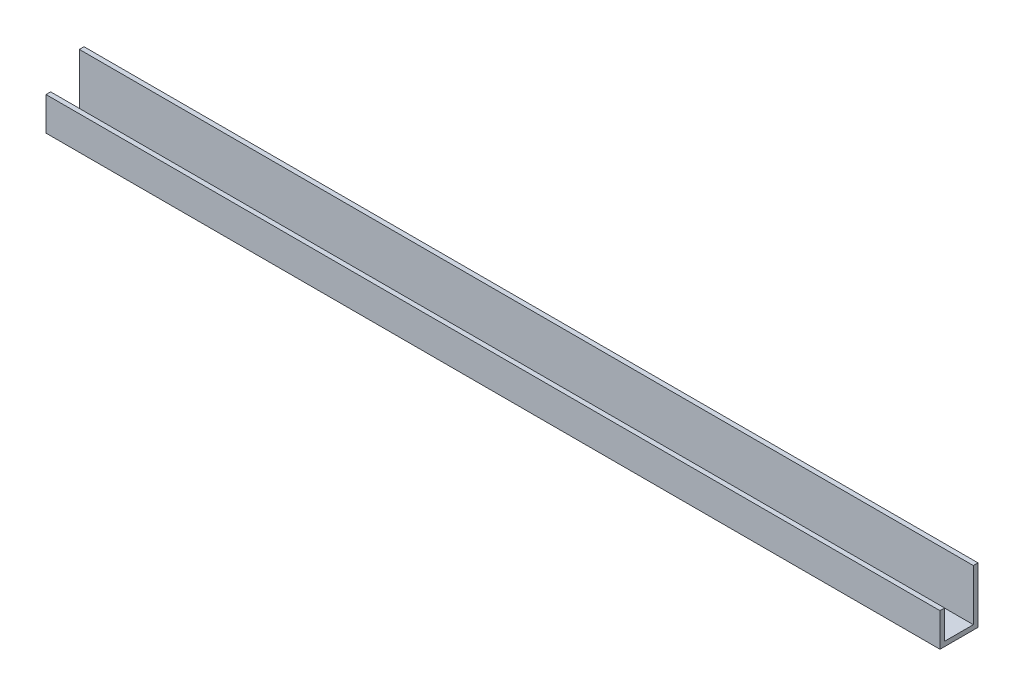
from build123d import *

# Parameters (mm, degrees)
SKETCH1_W           = 304.8
SKETCH1_H           = 12.954
BOSS_EXTRUDE1_DEPTH = 19.05
SKETCH2_W           = 304.8
SKETCH2_H           = 9.779
CUT_EXTRUDE1_DEPTH  = 17.4625
CUT_EXTRUDE2_REACH  = 307.669
SKETCH3_W           = 304.8
SKETCH3_H           = 7.6454


with BuildPart() as part:
    # Sketch1 → Boss-Extrude1 (new body)
    with BuildSketch(Plane(origin=(0, 0, 0), x_dir=(1, 0, 0), z_dir=(0, 1, 0))):
        with Locations((152.4, -6.477)):
            Rectangle(SKETCH1_W, SKETCH1_H)
    extrude(amount=BOSS_EXTRUDE1_DEPTH)

    # Sketch2 → Cut-Extrude1 (cut)
    with BuildSketch(Plane(origin=(0, 19.05, 0), x_dir=(1, 0, 0), z_dir=(0, 1, 0))):
        with Locations((152.4, -6.477)):
            Rectangle(SKETCH2_W, SKETCH2_H)
    extrude(amount=-CUT_EXTRUDE1_DEPTH, mode=Mode.SUBTRACT)

    # Sketch3 → Cut-Extrude2 (cut, up to next)
    with BuildSketch(Plane.XY.offset(12.954), mode=Mode.PRIVATE) as cut_extrude2_sk1:
        with Locations((152.4, 15.2273)):
            Rectangle(SKETCH3_W, SKETCH3_H)
    cut_extrude2_tool1 = extrude(cut_extrude2_sk1.sketch, amount=-CUT_EXTRUDE2_REACH, mode=Mode.PRIVATE) & part.part
    add(cut_extrude2_tool1.solids().sort_by_distance((152.4, 15.2273, 12.954))[0], mode=Mode.SUBTRACT)


solid = part.part
